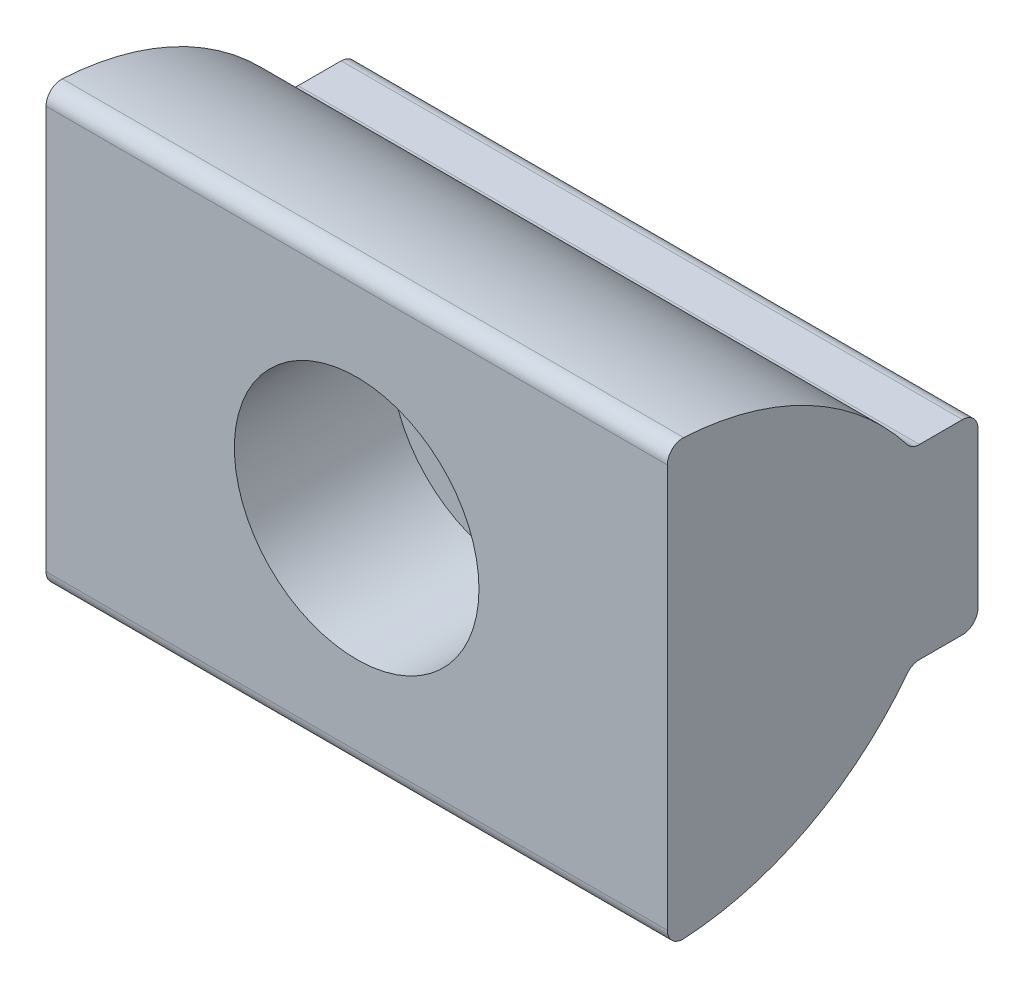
ISO-10303-21;
HEADER;
FILE_DESCRIPTION(('STEP AP214'),'2;1');
FILE_NAME('part.step','',(''),(''),'','','');
FILE_SCHEMA(('AUTOMOTIVE_DESIGN { 1 0 10303 214 1 1 1 1 }'));
ENDSEC;
DATA;
#1=APPLICATION_CONTEXT('core data for automotive mechanical design processes');
#2=APPLICATION_PROTOCOL_DEFINITION('international standard','automotive_design',2000,#1);
#3=PRODUCT_CONTEXT('',#1,'mechanical');
#4=PRODUCT('Part','Part','',(#3));
#5=PRODUCT_RELATED_PRODUCT_CATEGORY('part','',(#4));
#6=PRODUCT_DEFINITION_FORMATION('','',#4);
#7=PRODUCT_DEFINITION_CONTEXT('part definition',#1,'design');
#8=PRODUCT_DEFINITION('design','',#6,#7);
#9=PRODUCT_DEFINITION_SHAPE('','',#8);
#10=(LENGTH_UNIT() NAMED_UNIT(*) SI_UNIT(.MILLI.,.METRE.));
#11=(NAMED_UNIT(*) PLANE_ANGLE_UNIT() SI_UNIT($,.RADIAN.));
#12=(NAMED_UNIT(*) SI_UNIT($,.STERADIAN.) SOLID_ANGLE_UNIT());
#13=UNCERTAINTY_MEASURE_WITH_UNIT(LENGTH_MEASURE(1.E-05),#10,'distance_accuracy_value','');
#14=(GEOMETRIC_REPRESENTATION_CONTEXT(3) GLOBAL_UNCERTAINTY_ASSIGNED_CONTEXT((#13)) GLOBAL_UNIT_ASSIGNED_CONTEXT((#10,
#11,#12)) REPRESENTATION_CONTEXT('',''));
#15=CARTESIAN_POINT('',(0.,0.,0.));
#16=DIRECTION('',(0.,0.,1.));
#17=DIRECTION('',(1.,0.,0.));
#18=AXIS2_PLACEMENT_3D('',#15,#16,#17);
#19=CARTESIAN_POINT('',(31.75,-7.9375,1.5875));
#20=DIRECTION('',(-1.,0.,0.));
#21=DIRECTION('',(0.,-1.,0.));
#22=AXIS2_PLACEMENT_3D('',#19,#20,#21);
#23=CYLINDRICAL_SURFACE('',#22,1.5875);
#24=DIRECTION('',(-1.,0.,0.));
#25=VECTOR('',#24,1.);
#26=CARTESIAN_POINT('',(31.75,-7.9375,0.));
#27=LINE('',#26,#25);
#28=CARTESIAN_POINT('',(-2.24913177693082,-7.9375,0.));
#29=VERTEX_POINT('',#28);
#30=CARTESIAN_POINT('',(-31.75,-7.9375,0.));
#31=VERTEX_POINT('',#30);
#32=EDGE_CURVE('E137',#29,#31,#27,.T.);
#33=ORIENTED_EDGE('',*,*,#32,.F.);
#34=CARTESIAN_POINT('',(-2.24913177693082,-7.9375,0.));
#35=CARTESIAN_POINT('',(-2.13705447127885,-7.96925925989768,2.18139495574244E-05));
#36=CARTESIAN_POINT('',(-2.02431182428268,-7.99863956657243,0.0009534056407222));
#37=CARTESIAN_POINT('',(-1.79770152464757,-8.05259758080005,0.00394163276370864));
#38=CARTESIAN_POINT('',(-1.68383391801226,-8.07717548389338,0.00599822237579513));
#39=CARTESIAN_POINT('',(-1.45512837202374,-8.12149470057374,0.0105428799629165));
#40=CARTESIAN_POINT('',(-1.34029009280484,-8.14123424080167,0.0130311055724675));
#41=CARTESIAN_POINT('',(-1.10987791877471,-8.17583279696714,0.0178948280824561));
#42=CARTESIAN_POINT('',(-0.99430402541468,-8.19069182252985,0.0202703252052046));
#43=CARTESIAN_POINT('',(-0.765256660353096,-8.21522031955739,0.0244329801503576));
#44=CARTESIAN_POINT('',(-0.651795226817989,-8.2250001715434,0.0262322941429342));
#45=CARTESIAN_POINT('',(-0.424555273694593,-8.23985541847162,0.0290408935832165));
#46=CARTESIAN_POINT('',(-0.310776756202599,-8.24493084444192,0.0300501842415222));
#47=CARTESIAN_POINT('',(-0.0831459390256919,-8.25036620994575,0.0311327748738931));
#48=CARTESIAN_POINT('',(0.0307063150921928,-8.25072797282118,0.0312064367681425));
#49=CARTESIAN_POINT('',(0.25831562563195,-8.24674050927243,0.030409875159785));
#50=CARTESIAN_POINT('',(0.372072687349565,-8.24239156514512,0.0295397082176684));
#51=CARTESIAN_POINT('',(0.633654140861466,-8.2269646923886,0.0265867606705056));
#52=CARTESIAN_POINT('',(0.781381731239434,-8.21425006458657,0.0242169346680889));
#53=CARTESIAN_POINT('',(1.07589707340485,-8.18088688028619,0.0186779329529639));
#54=CARTESIAN_POINT('',(1.22268493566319,-8.16023927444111,0.0155088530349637));
#55=CARTESIAN_POINT('',(1.51717023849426,-8.11069181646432,0.00927468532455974));
#56=CARTESIAN_POINT('',(1.66484760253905,-8.08167132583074,0.00621190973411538));
#57=CARTESIAN_POINT('',(1.8850216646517,-8.03211406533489,0.00273613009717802));
#58=CARTESIAN_POINT('',(1.95819836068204,-8.01458800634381,0.00176388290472));
#59=CARTESIAN_POINT('',(2.1040523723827,-7.9775387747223,0.000397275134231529));
#60=CARTESIAN_POINT('',(2.17672967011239,-7.95801553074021,2.9352103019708E-06));
#61=CARTESIAN_POINT('',(2.24913177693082,-7.9375,0.));
#62=B_SPLINE_CURVE_WITH_KNOTS('',3,(#34,#35,#36,#37,#38,#39,#40,#41,#42,#43,#44,#45,#46,#47,#48,
#49,#50,#51,#52,#53,#54,#55,#56,#57,#58,#59,#60,#61),.UNSPECIFIED.,.F.,.F.,(4,2,2,2,2,2,2,2,2,2,
2,2,2,4),(0.,0.349429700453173,0.698845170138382,1.04838851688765,1.39793117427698,
1.73952106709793,2.08110870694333,2.42256420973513,2.76399925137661,3.20864649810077,
3.65324047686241,4.10459081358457,4.33032206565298,4.55606138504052),.UNSPECIFIED.);
#63=CARTESIAN_POINT('',(2.24913177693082,-7.9375,0.));
#64=VERTEX_POINT('',#63);
#65=EDGE_CURVE('E121',#29,#64,#62,.T.);
#66=ORIENTED_EDGE('',*,*,#65,.T.);
#67=CARTESIAN_POINT('',(31.75,-7.9375,0.));
#68=VERTEX_POINT('',#67);
#69=EDGE_CURVE('E131',#68,#64,#27,.T.);
#70=ORIENTED_EDGE('',*,*,#69,.F.);
#71=CARTESIAN_POINT('',(31.75,-7.9375,1.5875));
#72=DIRECTION('',(1.,0.,0.));
#73=DIRECTION('',(0.,1.,0.));
#74=AXIS2_PLACEMENT_3D('',#71,#72,#73);
#75=CIRCLE('',#74,1.5875);
#76=CARTESIAN_POINT('',(31.75,-9.525,1.5875));
#77=VERTEX_POINT('',#76);
#78=EDGE_CURVE('E198',#77,#68,#75,.T.);
#79=ORIENTED_EDGE('',*,*,#78,.F.);
#80=DIRECTION('',(-1.,0.,0.));
#81=VECTOR('',#80,1.);
#82=CARTESIAN_POINT('',(31.75,-9.525,1.5875));
#83=LINE('',#82,#81);
#84=CARTESIAN_POINT('',(-31.75,-9.525,1.5875));
#85=VERTEX_POINT('',#84);
#86=EDGE_CURVE('E145',#77,#85,#83,.T.);
#87=ORIENTED_EDGE('',*,*,#86,.T.);
#88=CARTESIAN_POINT('',(-31.75,-7.9375,1.5875));
#89=DIRECTION('',(1.,0.,0.));
#90=DIRECTION('',(0.,1.,0.));
#91=AXIS2_PLACEMENT_3D('',#88,#89,#90);
#92=CIRCLE('',#91,1.5875);
#93=EDGE_CURVE('E168',#85,#31,#92,.T.);
#94=ORIENTED_EDGE('',*,*,#93,.T.);
#95=EDGE_LOOP('',(#33,#66,#70,#79,#87,#94));
#96=FACE_BOUND('',#95,.T.);
#97=ADVANCED_FACE('F14',(#96),#23,.T.);
#98=CARTESIAN_POINT('',(31.75,-7.9375,0.));
#99=DIRECTION('',(0.,0.,1.));
#100=DIRECTION('',(1.,0.,0.));
#101=AXIS2_PLACEMENT_3D('',#98,#99,#100);
#102=PLANE('',#101);
#103=DIRECTION('',(-1.,0.,0.));
#104=VECTOR('',#103,1.);
#105=CARTESIAN_POINT('',(31.75,7.9375,0.));
#106=LINE('',#105,#104);
#107=CARTESIAN_POINT('',(-2.24913177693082,7.9375,0.));
#108=VERTEX_POINT('',#107);
#109=CARTESIAN_POINT('',(-31.75,7.9375,0.));
#110=VERTEX_POINT('',#109);
#111=EDGE_CURVE('E138',#108,#110,#106,.T.);
#112=ORIENTED_EDGE('',*,*,#111,.F.);
#113=CARTESIAN_POINT('',(0.,0.,0.));
#114=DIRECTION('',(0.,0.,1.));
#115=DIRECTION('',(1.,0.,0.));
#116=AXIS2_PLACEMENT_3D('',#113,#114,#115);
#117=CIRCLE('',#116,8.25);
#118=EDGE_CURVE('E29',#108,#29,#117,.T.);
#119=ORIENTED_EDGE('',*,*,#118,.T.);
#120=ORIENTED_EDGE('',*,*,#32,.T.);
#121=DIRECTION('',(0.,1.,0.));
#122=VECTOR('',#121,1.);
#123=CARTESIAN_POINT('',(-31.75,-7.9375,0.));
#124=LINE('',#123,#122);
#125=EDGE_CURVE('E176',#31,#110,#124,.T.);
#126=ORIENTED_EDGE('',*,*,#125,.T.);
#127=EDGE_LOOP('',(#112,#119,#120,#126));
#128=FACE_BOUND('',#127,.T.);
#129=ADVANCED_FACE('F306',(#128),#102,.F.);
#130=ORIENTED_EDGE('',*,*,#69,.T.);
#131=CARTESIAN_POINT('',(2.24913177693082,7.9375,0.));
#132=VERTEX_POINT('',#131);
#133=EDGE_CURVE('E116',#64,#132,#117,.T.);
#134=ORIENTED_EDGE('',*,*,#133,.T.);
#135=CARTESIAN_POINT('',(31.75,7.9375,0.));
#136=VERTEX_POINT('',#135);
#137=EDGE_CURVE('E128',#136,#132,#106,.T.);
#138=ORIENTED_EDGE('',*,*,#137,.F.);
#139=DIRECTION('',(0.,1.,0.));
#140=VECTOR('',#139,1.);
#141=CARTESIAN_POINT('',(31.75,-7.9375,0.));
#142=LINE('',#141,#140);
#143=EDGE_CURVE('E200',#68,#136,#142,.T.);
#144=ORIENTED_EDGE('',*,*,#143,.F.);
#145=EDGE_LOOP('',(#130,#134,#138,#144));
#146=FACE_BOUND('',#145,.T.);
#147=ADVANCED_FACE('F126',(#146),#102,.F.);
#148=CARTESIAN_POINT('',(31.75,7.9375,1.5875));
#149=DIRECTION('',(-1.,0.,0.));
#150=DIRECTION('',(0.,-1.,0.));
#151=AXIS2_PLACEMENT_3D('',#148,#149,#150);
#152=CYLINDRICAL_SURFACE('',#151,1.5875);
#153=ORIENTED_EDGE('',*,*,#137,.T.);
#154=CARTESIAN_POINT('',(2.24913177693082,7.9375,0.));
#155=CARTESIAN_POINT('',(2.13705447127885,7.96925925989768,2.18139495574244E-05));
#156=CARTESIAN_POINT('',(2.02431182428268,7.99863956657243,0.0009534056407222));
#157=CARTESIAN_POINT('',(1.79770152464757,8.05259758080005,0.00394163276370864));
#158=CARTESIAN_POINT('',(1.68383391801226,8.07717548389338,0.00599822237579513));
#159=CARTESIAN_POINT('',(1.45512837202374,8.12149470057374,0.0105428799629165));
#160=CARTESIAN_POINT('',(1.34029009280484,8.14123424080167,0.0130311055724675));
#161=CARTESIAN_POINT('',(1.10987791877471,8.17583279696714,0.0178948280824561));
#162=CARTESIAN_POINT('',(0.99430402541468,8.19069182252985,0.0202703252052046));
#163=CARTESIAN_POINT('',(0.765256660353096,8.21522031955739,0.0244329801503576));
#164=CARTESIAN_POINT('',(0.651795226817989,8.2250001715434,0.0262322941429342));
#165=CARTESIAN_POINT('',(0.424555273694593,8.23985541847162,0.0290408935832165));
#166=CARTESIAN_POINT('',(0.310776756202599,8.24493084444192,0.0300501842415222));
#167=CARTESIAN_POINT('',(0.0831459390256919,8.25036620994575,0.0311327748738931));
#168=CARTESIAN_POINT('',(-0.0307063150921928,8.25072797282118,0.0312064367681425));
#169=CARTESIAN_POINT('',(-0.25831562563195,8.24674050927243,0.030409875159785));
#170=CARTESIAN_POINT('',(-0.372072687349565,8.24239156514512,0.0295397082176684));
#171=CARTESIAN_POINT('',(-0.633654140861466,8.2269646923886,0.0265867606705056));
#172=CARTESIAN_POINT('',(-0.781381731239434,8.21425006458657,0.0242169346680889));
#173=CARTESIAN_POINT('',(-1.07589707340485,8.18088688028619,0.0186779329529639));
#174=CARTESIAN_POINT('',(-1.22268493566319,8.16023927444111,0.0155088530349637));
#175=CARTESIAN_POINT('',(-1.51717023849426,8.11069181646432,0.00927468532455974));
#176=CARTESIAN_POINT('',(-1.66484760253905,8.08167132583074,0.00621190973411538));
#177=CARTESIAN_POINT('',(-1.8850216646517,8.03211406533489,0.00273613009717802));
#178=CARTESIAN_POINT('',(-1.95819836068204,8.01458800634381,0.00176388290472));
#179=CARTESIAN_POINT('',(-2.1040523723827,7.9775387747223,0.000397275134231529));
#180=CARTESIAN_POINT('',(-2.17672967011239,7.95801553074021,2.9352103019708E-06));
#181=CARTESIAN_POINT('',(-2.24913177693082,7.9375,0.));
#182=B_SPLINE_CURVE_WITH_KNOTS('',3,(#154,#155,#156,#157,#158,#159,#160,#161,#162,#163,#164,
#165,#166,#167,#168,#169,#170,#171,#172,#173,#174,#175,#176,#177,#178,#179,#180,#181),
.UNSPECIFIED.,.F.,.F.,(4,2,2,2,2,2,2,2,2,2,2,2,2,4),(0.,0.349429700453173,0.698845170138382,
1.04838851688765,1.39793117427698,1.73952106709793,2.08110870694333,2.42256420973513,
2.76399925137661,3.20864649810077,3.65324047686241,4.10459081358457,4.33032206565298,
4.55606138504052),.UNSPECIFIED.);
#183=EDGE_CURVE('E113',#132,#108,#182,.T.);
#184=ORIENTED_EDGE('',*,*,#183,.T.);
#185=ORIENTED_EDGE('',*,*,#111,.T.);
#186=CARTESIAN_POINT('',(-31.75,7.9375,1.5875));
#187=DIRECTION('',(1.,0.,0.));
#188=DIRECTION('',(0.,1.,0.));
#189=AXIS2_PLACEMENT_3D('',#186,#187,#188);
#190=CIRCLE('',#189,1.5875);
#191=CARTESIAN_POINT('',(-31.75,9.525,1.5875));
#192=VERTEX_POINT('',#191);
#193=EDGE_CURVE('E179',#110,#192,#190,.T.);
#194=ORIENTED_EDGE('',*,*,#193,.T.);
#195=DIRECTION('',(-1.,0.,0.));
#196=VECTOR('',#195,1.);
#197=CARTESIAN_POINT('',(31.75,9.525,1.5875));
#198=LINE('',#197,#196);
#199=CARTESIAN_POINT('',(31.75,9.525,1.5875));
#200=VERTEX_POINT('',#199);
#201=EDGE_CURVE('E141',#200,#192,#198,.T.);
#202=ORIENTED_EDGE('',*,*,#201,.F.);
#203=CARTESIAN_POINT('',(31.75,7.9375,1.5875));
#204=DIRECTION('',(1.,0.,0.));
#205=DIRECTION('',(0.,1.,0.));
#206=AXIS2_PLACEMENT_3D('',#203,#204,#205);
#207=CIRCLE('',#206,1.5875);
#208=EDGE_CURVE('E136',#136,#200,#207,.T.);
#209=ORIENTED_EDGE('',*,*,#208,.F.);
#210=EDGE_LOOP('',(#153,#184,#185,#194,#202,#209));
#211=FACE_BOUND('',#210,.T.);
#212=ADVANCED_FACE('F134',(#211),#152,.T.);
#213=CARTESIAN_POINT('',(31.75,-20.5944714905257,31.75));
#214=DIRECTION('',(0.,0.,-1.));
#215=DIRECTION('',(-1.,0.,0.));
#216=AXIS2_PLACEMENT_3D('',#213,#214,#215);
#217=PLANE('',#216);
#218=CARTESIAN_POINT('',(0.,0.,31.75));
#219=DIRECTION('',(0.,0.,1.));
#220=DIRECTION('',(1.,0.,0.));
#221=AXIS2_PLACEMENT_3D('',#218,#219,#220);
#222=CIRCLE('',#221,12.5);
#223=CARTESIAN_POINT('',(12.5,0.,31.75));
#224=VERTEX_POINT('',#223);
#225=EDGE_CURVE('E252',#224,#224,#222,.T.);
#226=ORIENTED_EDGE('',*,*,#225,.F.);
#227=EDGE_LOOP('',(#226));
#228=FACE_BOUND('',#227,.T.);
#229=DIRECTION('',(0.,-1.,0.));
#230=VECTOR('',#229,1.);
#231=CARTESIAN_POINT('',(-31.75,-20.5944714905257,31.75));
#232=LINE('',#231,#230);
#233=CARTESIAN_POINT('',(-31.75,20.5944714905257,31.75));
#234=VERTEX_POINT('',#233);
#235=CARTESIAN_POINT('',(-31.75,-20.5944714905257,31.75));
#236=VERTEX_POINT('',#235);
#237=EDGE_CURVE('E189',#234,#236,#232,.T.);
#238=ORIENTED_EDGE('',*,*,#237,.T.);
#239=DIRECTION('',(-1.,0.,0.));
#240=VECTOR('',#239,1.);
#241=CARTESIAN_POINT('',(31.75,-20.5944714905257,31.75));
#242=LINE('',#241,#240);
#243=CARTESIAN_POINT('',(31.75,-20.5944714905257,31.75));
#244=VERTEX_POINT('',#243);
#245=EDGE_CURVE('E212',#244,#236,#242,.T.);
#246=ORIENTED_EDGE('',*,*,#245,.F.);
#247=DIRECTION('',(0.,-1.,0.));
#248=VECTOR('',#247,1.);
#249=CARTESIAN_POINT('',(31.75,-20.5944714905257,31.75));
#250=LINE('',#249,#248);
#251=CARTESIAN_POINT('',(31.75,20.5944714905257,31.75));
#252=VERTEX_POINT('',#251);
#253=EDGE_CURVE('E37',#252,#244,#250,.T.);
#254=ORIENTED_EDGE('',*,*,#253,.F.);
#255=DIRECTION('',(-1.,0.,0.));
#256=VECTOR('',#255,1.);
#257=CARTESIAN_POINT('',(31.75,20.5944714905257,31.75));
#258=LINE('',#257,#256);
#259=EDGE_CURVE('E215',#252,#234,#258,.T.);
#260=ORIENTED_EDGE('',*,*,#259,.T.);
#261=EDGE_LOOP('',(#238,#246,#254,#260));
#262=FACE_BOUND('',#261,.T.);
#263=ADVANCED_FACE('F291',(#228,#262),#217,.F.);
#264=CARTESIAN_POINT('',(31.75,-20.5944714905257,30.1625));
#265=DIRECTION('',(-1.,0.,0.));
#266=DIRECTION('',(0.,-1.,0.));
#267=AXIS2_PLACEMENT_3D('',#264,#265,#266);
#268=CYLINDRICAL_SURFACE('',#267,1.5875);
#269=CARTESIAN_POINT('',(-31.75,-20.5944714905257,30.1625));
#270=DIRECTION('',(1.,0.,0.));
#271=DIRECTION('',(0.,-1.,0.));
#272=AXIS2_PLACEMENT_3D('',#269,#270,#271);
#273=CIRCLE('',#272,1.5875);
#274=CARTESIAN_POINT('',(-31.75,-22.1796406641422,30.076506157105));
#275=VERTEX_POINT('',#274);
#276=EDGE_CURVE('E170',#236,#275,#273,.T.);
#277=ORIENTED_EDGE('',*,*,#276,.T.);
#278=DIRECTION('',(-1.,0.,0.));
#279=VECTOR('',#278,1.);
#280=CARTESIAN_POINT('',(31.75,-22.1796406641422,30.076506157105));
#281=LINE('',#280,#279);
#282=CARTESIAN_POINT('',(31.75,-22.1796406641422,30.076506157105));
#283=VERTEX_POINT('',#282);
#284=EDGE_CURVE('E9',#283,#275,#281,.T.);
#285=ORIENTED_EDGE('',*,*,#284,.F.);
#286=CARTESIAN_POINT('',(31.75,-20.5944714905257,30.1625));
#287=DIRECTION('',(1.,0.,0.));
#288=DIRECTION('',(0.,-1.,0.));
#289=AXIS2_PLACEMENT_3D('',#286,#287,#288);
#290=CIRCLE('',#289,1.5875);
#291=EDGE_CURVE('E191',#244,#283,#290,.T.);
#292=ORIENTED_EDGE('',*,*,#291,.F.);
#293=ORIENTED_EDGE('',*,*,#245,.T.);
#294=EDGE_LOOP('',(#277,#285,#292,#293));
#295=FACE_BOUND('',#294,.T.);
#296=ADVANCED_FACE('F16',(#295),#268,.T.);
#297=CARTESIAN_POINT('',(31.75,8.66874060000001,31.75));
#298=DIRECTION('',(-1.,0.,0.));
#299=DIRECTION('',(0.,-1.,0.));
#300=AXIS2_PLACEMENT_3D('',#297,#298,#299);
#301=CYLINDRICAL_SURFACE('',#300,30.8937406);
#302=CARTESIAN_POINT('',(-31.75,8.66874060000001,31.75));
#303=DIRECTION('',(1.,0.,0.));
#304=DIRECTION('',(0.,1.,0.));
#305=AXIS2_PLACEMENT_3D('',#302,#303,#304);
#306=CIRCLE('',#305,30.8937406);
#307=CARTESIAN_POINT('',(-31.75,-10.1457044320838,7.24612548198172));
#308=VERTEX_POINT('',#307);
#309=EDGE_CURVE('E164',#275,#308,#306,.T.);
#310=ORIENTED_EDGE('',*,*,#309,.T.);
#311=DIRECTION('',(-1.,0.,0.));
#312=VECTOR('',#311,1.);
#313=CARTESIAN_POINT('',(31.75,-10.1457044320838,7.24612548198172));
#314=LINE('',#313,#312);
#315=CARTESIAN_POINT('',(31.75,-10.1457044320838,7.24612548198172));
#316=VERTEX_POINT('',#315);
#317=EDGE_CURVE('E22',#316,#308,#314,.T.);
#318=ORIENTED_EDGE('',*,*,#317,.F.);
#319=CARTESIAN_POINT('',(31.75,8.66874060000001,31.75));
#320=DIRECTION('',(1.,0.,0.));
#321=DIRECTION('',(0.,1.,0.));
#322=AXIS2_PLACEMENT_3D('',#319,#320,#321);
#323=CIRCLE('',#322,30.8937406);
#324=EDGE_CURVE('E193',#283,#316,#323,.T.);
#325=ORIENTED_EDGE('',*,*,#324,.F.);
#326=ORIENTED_EDGE('',*,*,#284,.T.);
#327=EDGE_LOOP('',(#310,#318,#325,#326));
#328=FACE_BOUND('',#327,.T.);
#329=ADVANCED_FACE('F321',(#328),#301,.T.);
#330=CARTESIAN_POINT('',(31.75,-11.1125,5.98697395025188));
#331=DIRECTION('',(-1.,0.,0.));
#332=DIRECTION('',(0.,-1.,0.));
#333=AXIS2_PLACEMENT_3D('',#330,#331,#332);
#334=CYLINDRICAL_SURFACE('',#333,1.5875);
#335=CARTESIAN_POINT('',(-31.75,-11.1125,5.98697395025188));
#336=DIRECTION('',(-1.,0.,0.));
#337=DIRECTION('',(0.,-1.,0.));
#338=AXIS2_PLACEMENT_3D('',#335,#336,#337);
#339=CIRCLE('',#338,1.5875);
#340=CARTESIAN_POINT('',(-31.75,-9.525,5.98697395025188));
#341=VERTEX_POINT('',#340);
#342=EDGE_CURVE('E157',#308,#341,#339,.T.);
#343=ORIENTED_EDGE('',*,*,#342,.T.);
#344=DIRECTION('',(-1.,0.,0.));
#345=VECTOR('',#344,1.);
#346=CARTESIAN_POINT('',(31.75,-9.525,5.98697395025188));
#347=LINE('',#346,#345);
#348=CARTESIAN_POINT('',(31.75,-9.525,5.98697395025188));
#349=VERTEX_POINT('',#348);
#350=EDGE_CURVE('E148',#349,#341,#347,.T.);
#351=ORIENTED_EDGE('',*,*,#350,.F.);
#352=CARTESIAN_POINT('',(31.75,-11.1125,5.98697395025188));
#353=DIRECTION('',(-1.,0.,0.));
#354=DIRECTION('',(0.,-1.,0.));
#355=AXIS2_PLACEMENT_3D('',#352,#353,#354);
#356=CIRCLE('',#355,1.5875);
#357=EDGE_CURVE('E158',#316,#349,#356,.T.);
#358=ORIENTED_EDGE('',*,*,#357,.F.);
#359=ORIENTED_EDGE('',*,*,#317,.T.);
#360=EDGE_LOOP('',(#343,#351,#358,#359));
#361=FACE_BOUND('',#360,.T.);
#362=ADVANCED_FACE('F155',(#361),#334,.F.);
#363=CARTESIAN_POINT('',(31.75,-9.525,1.5875));
#364=DIRECTION('',(0.,1.,0.));
#365=DIRECTION('',(-1.,0.,0.));
#366=AXIS2_PLACEMENT_3D('',#363,#364,#365);
#367=PLANE('',#366);
#368=DIRECTION('',(0.,0.,-1.));
#369=VECTOR('',#368,1.);
#370=CARTESIAN_POINT('',(-31.75,-9.525,1.5875));
#371=LINE('',#370,#369);
#372=EDGE_CURVE('E166',#341,#85,#371,.T.);
#373=ORIENTED_EDGE('',*,*,#372,.T.);
#374=ORIENTED_EDGE('',*,*,#86,.F.);
#375=DIRECTION('',(0.,0.,-1.));
#376=VECTOR('',#375,1.);
#377=CARTESIAN_POINT('',(31.75,-9.525,1.5875));
#378=LINE('',#377,#376);
#379=EDGE_CURVE('E196',#349,#77,#378,.T.);
#380=ORIENTED_EDGE('',*,*,#379,.F.);
#381=ORIENTED_EDGE('',*,*,#350,.T.);
#382=EDGE_LOOP('',(#373,#374,#380,#381));
#383=FACE_BOUND('',#382,.T.);
#384=ADVANCED_FACE('F303',(#383),#367,.F.);
#385=CARTESIAN_POINT('',(31.75,9.525,1.5875));
#386=DIRECTION('',(0.,-1.,0.));
#387=DIRECTION('',(1.,0.,0.));
#388=AXIS2_PLACEMENT_3D('',#385,#386,#387);
#389=PLANE('',#388);
#390=DIRECTION('',(0.,0.,1.));
#391=VECTOR('',#390,1.);
#392=CARTESIAN_POINT('',(-31.75,9.525,1.5875));
#393=LINE('',#392,#391);
#394=CARTESIAN_POINT('',(-31.75,9.525,5.98697395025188));
#395=VERTEX_POINT('',#394);
#396=EDGE_CURVE('E181',#192,#395,#393,.T.);
#397=ORIENTED_EDGE('',*,*,#396,.T.);
#398=DIRECTION('',(-1.,0.,0.));
#399=VECTOR('',#398,1.);
#400=CARTESIAN_POINT('',(31.75,9.525,5.98697395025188));
#401=LINE('',#400,#399);
#402=CARTESIAN_POINT('',(31.75,9.525,5.98697395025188));
#403=VERTEX_POINT('',#402);
#404=EDGE_CURVE('E223',#403,#395,#401,.T.);
#405=ORIENTED_EDGE('',*,*,#404,.F.);
#406=DIRECTION('',(0.,0.,1.));
#407=VECTOR('',#406,1.);
#408=CARTESIAN_POINT('',(31.75,9.525,1.5875));
#409=LINE('',#408,#407);
#410=EDGE_CURVE('E203',#200,#403,#409,.T.);
#411=ORIENTED_EDGE('',*,*,#410,.F.);
#412=ORIENTED_EDGE('',*,*,#201,.T.);
#413=EDGE_LOOP('',(#397,#405,#411,#412));
#414=FACE_BOUND('',#413,.T.);
#415=ADVANCED_FACE('F233',(#414),#389,.F.);
#416=CARTESIAN_POINT('',(31.75,11.1125,5.98697395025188));
#417=DIRECTION('',(-1.,0.,0.));
#418=DIRECTION('',(0.,-1.,0.));
#419=AXIS2_PLACEMENT_3D('',#416,#417,#418);
#420=CYLINDRICAL_SURFACE('',#419,1.5875);
#421=CARTESIAN_POINT('',(-31.75,11.1125,5.98697395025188));
#422=DIRECTION('',(-1.,0.,0.));
#423=DIRECTION('',(0.,-1.,0.));
#424=AXIS2_PLACEMENT_3D('',#421,#422,#423);
#425=CIRCLE('',#424,1.5875);
#426=CARTESIAN_POINT('',(-31.75,10.1457044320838,7.24612548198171));
#427=VERTEX_POINT('',#426);
#428=EDGE_CURVE('E183',#395,#427,#425,.T.);
#429=ORIENTED_EDGE('',*,*,#428,.T.);
#430=DIRECTION('',(-1.,0.,0.));
#431=VECTOR('',#430,1.);
#432=CARTESIAN_POINT('',(31.75,10.1457044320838,7.24612548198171));
#433=LINE('',#432,#431);
#434=CARTESIAN_POINT('',(31.75,10.1457044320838,7.24612548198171));
#435=VERTEX_POINT('',#434);
#436=EDGE_CURVE('E221',#435,#427,#433,.T.);
#437=ORIENTED_EDGE('',*,*,#436,.F.);
#438=CARTESIAN_POINT('',(31.75,11.1125,5.98697395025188));
#439=DIRECTION('',(-1.,0.,0.));
#440=DIRECTION('',(0.,-1.,0.));
#441=AXIS2_PLACEMENT_3D('',#438,#439,#440);
#442=CIRCLE('',#441,1.5875);
#443=EDGE_CURVE('E205',#403,#435,#442,.T.);
#444=ORIENTED_EDGE('',*,*,#443,.F.);
#445=ORIENTED_EDGE('',*,*,#404,.T.);
#446=EDGE_LOOP('',(#429,#437,#444,#445));
#447=FACE_BOUND('',#446,.T.);
#448=ADVANCED_FACE('F239',(#447),#420,.F.);
#449=CARTESIAN_POINT('',(31.75,-8.66874060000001,31.75));
#450=DIRECTION('',(-1.,0.,0.));
#451=DIRECTION('',(0.,-1.,0.));
#452=AXIS2_PLACEMENT_3D('',#449,#450,#451);
#453=CYLINDRICAL_SURFACE('',#452,30.8937406);
#454=CARTESIAN_POINT('',(-31.75,-8.66874060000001,31.75));
#455=DIRECTION('',(1.,0.,0.));
#456=DIRECTION('',(0.,-1.,0.));
#457=AXIS2_PLACEMENT_3D('',#454,#455,#456);
#458=CIRCLE('',#457,30.8937406);
#459=CARTESIAN_POINT('',(-31.75,22.1796406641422,30.076506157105));
#460=VERTEX_POINT('',#459);
#461=EDGE_CURVE('E185',#427,#460,#458,.T.);
#462=ORIENTED_EDGE('',*,*,#461,.T.);
#463=DIRECTION('',(-1.,0.,0.));
#464=VECTOR('',#463,1.);
#465=CARTESIAN_POINT('',(31.75,22.1796406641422,30.076506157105));
#466=LINE('',#465,#464);
#467=CARTESIAN_POINT('',(31.75,22.1796406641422,30.076506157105));
#468=VERTEX_POINT('',#467);
#469=EDGE_CURVE('E218',#468,#460,#466,.T.);
#470=ORIENTED_EDGE('',*,*,#469,.F.);
#471=CARTESIAN_POINT('',(31.75,-8.66874060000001,31.75));
#472=DIRECTION('',(1.,0.,0.));
#473=DIRECTION('',(0.,-1.,0.));
#474=AXIS2_PLACEMENT_3D('',#471,#472,#473);
#475=CIRCLE('',#474,30.8937406);
#476=EDGE_CURVE('E207',#435,#468,#475,.T.);
#477=ORIENTED_EDGE('',*,*,#476,.F.);
#478=ORIENTED_EDGE('',*,*,#436,.T.);
#479=EDGE_LOOP('',(#462,#470,#477,#478));
#480=FACE_BOUND('',#479,.T.);
#481=ADVANCED_FACE('F242',(#480),#453,.T.);
#482=CARTESIAN_POINT('',(31.75,20.5944714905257,30.1625));
#483=DIRECTION('',(-1.,0.,0.));
#484=DIRECTION('',(0.,-1.,0.));
#485=AXIS2_PLACEMENT_3D('',#482,#483,#484);
#486=CYLINDRICAL_SURFACE('',#485,1.5875);
#487=CARTESIAN_POINT('',(-31.75,20.5944714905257,30.1625));
#488=DIRECTION('',(1.,0.,0.));
#489=DIRECTION('',(0.,-1.,0.));
#490=AXIS2_PLACEMENT_3D('',#487,#488,#489);
#491=CIRCLE('',#490,1.5875);
#492=EDGE_CURVE('E187',#460,#234,#491,.T.);
#493=ORIENTED_EDGE('',*,*,#492,.T.);
#494=ORIENTED_EDGE('',*,*,#259,.F.);
#495=CARTESIAN_POINT('',(31.75,20.5944714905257,30.1625));
#496=DIRECTION('',(1.,0.,0.));
#497=DIRECTION('',(0.,-1.,0.));
#498=AXIS2_PLACEMENT_3D('',#495,#496,#497);
#499=CIRCLE('',#498,1.5875);
#500=EDGE_CURVE('E209',#468,#252,#499,.T.);
#501=ORIENTED_EDGE('',*,*,#500,.F.);
#502=ORIENTED_EDGE('',*,*,#469,.T.);
#503=EDGE_LOOP('',(#493,#494,#501,#502));
#504=FACE_BOUND('',#503,.T.);
#505=ADVANCED_FACE('F290',(#504),#486,.T.);
#506=CARTESIAN_POINT('',(31.75,-20.5944714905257,30.1625));
#507=DIRECTION('',(-1.,0.,0.));
#508=DIRECTION('',(0.,-1.,0.));
#509=AXIS2_PLACEMENT_3D('',#506,#507,#508);
#510=PLANE('',#509);
#511=ORIENTED_EDGE('',*,*,#291,.T.);
#512=ORIENTED_EDGE('',*,*,#324,.T.);
#513=ORIENTED_EDGE('',*,*,#357,.T.);
#514=ORIENTED_EDGE('',*,*,#379,.T.);
#515=ORIENTED_EDGE('',*,*,#78,.T.);
#516=ORIENTED_EDGE('',*,*,#143,.T.);
#517=ORIENTED_EDGE('',*,*,#208,.T.);
#518=ORIENTED_EDGE('',*,*,#410,.T.);
#519=ORIENTED_EDGE('',*,*,#443,.T.);
#520=ORIENTED_EDGE('',*,*,#476,.T.);
#521=ORIENTED_EDGE('',*,*,#500,.T.);
#522=ORIENTED_EDGE('',*,*,#253,.T.);
#523=EDGE_LOOP('',(#511,#512,#513,#514,#515,#516,#517,#518,#519,#520,#521,#522));
#524=FACE_BOUND('',#523,.T.);
#525=ADVANCED_FACE('F245',(#524),#510,.F.);
#526=CARTESIAN_POINT('',(-31.75,-20.5944714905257,30.1625));
#527=DIRECTION('',(-1.,0.,0.));
#528=DIRECTION('',(0.,-1.,0.));
#529=AXIS2_PLACEMENT_3D('',#526,#527,#528);
#530=PLANE('',#529);
#531=ORIENTED_EDGE('',*,*,#276,.F.);
#532=ORIENTED_EDGE('',*,*,#237,.F.);
#533=ORIENTED_EDGE('',*,*,#492,.F.);
#534=ORIENTED_EDGE('',*,*,#461,.F.);
#535=ORIENTED_EDGE('',*,*,#428,.F.);
#536=ORIENTED_EDGE('',*,*,#396,.F.);
#537=ORIENTED_EDGE('',*,*,#193,.F.);
#538=ORIENTED_EDGE('',*,*,#125,.F.);
#539=ORIENTED_EDGE('',*,*,#93,.F.);
#540=ORIENTED_EDGE('',*,*,#372,.F.);
#541=ORIENTED_EDGE('',*,*,#342,.F.);
#542=ORIENTED_EDGE('',*,*,#309,.F.);
#543=EDGE_LOOP('',(#531,#532,#533,#534,#535,#536,#537,#538,#539,#540,#541,#542));
#544=FACE_BOUND('',#543,.T.);
#545=ADVANCED_FACE('F163',(#544),#530,.T.);
#546=CARTESIAN_POINT('',(0.,0.,15.75));
#547=DIRECTION('',(0.,0.,1.));
#548=DIRECTION('',(1.,0.,0.));
#549=AXIS2_PLACEMENT_3D('',#546,#547,#548);
#550=CYLINDRICAL_SURFACE('',#549,12.5);
#551=CARTESIAN_POINT('',(0.,0.,15.75));
#552=DIRECTION('',(0.,0.,1.));
#553=DIRECTION('',(1.,0.,0.));
#554=AXIS2_PLACEMENT_3D('',#551,#552,#553);
#555=CIRCLE('',#554,12.5);
#556=CARTESIAN_POINT('',(12.5,0.,15.75));
#557=VERTEX_POINT('',#556);
#558=EDGE_CURVE('E255',#557,#557,#555,.T.);
#559=ORIENTED_EDGE('',*,*,#558,.F.);
#560=EDGE_LOOP('',(#559));
#561=FACE_BOUND('',#560,.T.);
#562=ORIENTED_EDGE('',*,*,#225,.T.);
#563=EDGE_LOOP('',(#562));
#564=FACE_BOUND('',#563,.T.);
#565=ADVANCED_FACE('F281',(#561,#564),#550,.F.);
#566=CARTESIAN_POINT('',(0.,0.,15.75));
#567=DIRECTION('',(0.,0.,1.));
#568=DIRECTION('',(1.,0.,0.));
#569=AXIS2_PLACEMENT_3D('',#566,#567,#568);
#570=PLANE('',#569);
#571=CARTESIAN_POINT('',(0.,0.,15.75));
#572=DIRECTION('',(0.,0.,1.));
#573=DIRECTION('',(1.,0.,0.));
#574=AXIS2_PLACEMENT_3D('',#571,#572,#573);
#575=CIRCLE('',#574,8.25);
#576=CARTESIAN_POINT('',(8.25,0.,15.75));
#577=VERTEX_POINT('',#576);
#578=EDGE_CURVE('E132',#577,#577,#575,.T.);
#579=ORIENTED_EDGE('',*,*,#578,.F.);
#580=EDGE_LOOP('',(#579));
#581=FACE_BOUND('',#580,.T.);
#582=ORIENTED_EDGE('',*,*,#558,.T.);
#583=EDGE_LOOP('',(#582));
#584=FACE_BOUND('',#583,.T.);
#585=ADVANCED_FACE('F276',(#581,#584),#570,.T.);
#586=CARTESIAN_POINT('',(0.,0.,0.));
#587=DIRECTION('',(0.,0.,1.));
#588=DIRECTION('',(1.,0.,0.));
#589=AXIS2_PLACEMENT_3D('',#586,#587,#588);
#590=CYLINDRICAL_SURFACE('',#589,8.25);
#591=ORIENTED_EDGE('',*,*,#578,.T.);
#592=EDGE_LOOP('',(#591));
#593=FACE_BOUND('',#592,.T.);
#594=ORIENTED_EDGE('',*,*,#118,.F.);
#595=ORIENTED_EDGE('',*,*,#183,.F.);
#596=ORIENTED_EDGE('',*,*,#133,.F.);
#597=ORIENTED_EDGE('',*,*,#65,.F.);
#598=EDGE_LOOP('',(#594,#595,#596,#597));
#599=FACE_BOUND('',#598,.T.);
#600=ADVANCED_FACE('F115',(#593,#599),#590,.F.);
#601=CLOSED_SHELL('',(#97,#129,#147,#212,#263,#296,#329,#362,#384,#415,#448,#481,#505,#525,#545,
#565,#585,#600));
#602=MANIFOLD_SOLID_BREP('B1',#601);
#603=ADVANCED_BREP_SHAPE_REPRESENTATION('',(#18,#602),#14);
#604=SHAPE_DEFINITION_REPRESENTATION(#9,#603);
ENDSEC;
END-ISO-10303-21;
